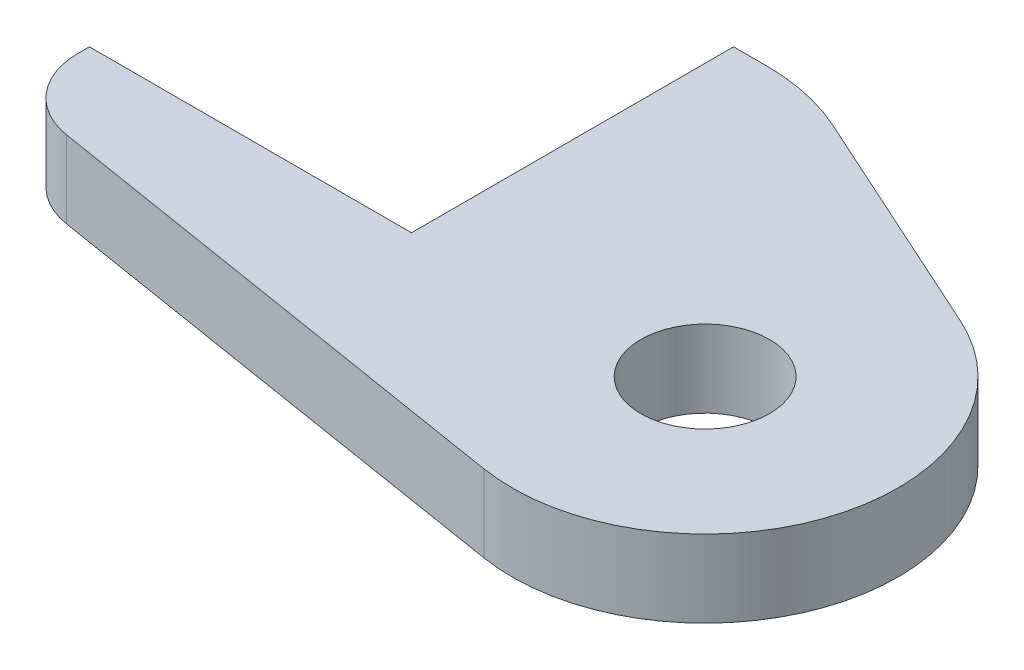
from build123d import *

# Parameters (mm, degrees)
SKETCH1_R           = 7.9375
BOSS_EXTRUDE1_DEPTH = 4.7625
CHAMFER1_SIZE       = 3.175


with BuildPart() as part:
    # Sketch1 → Boss-Extrude1 (new, symmetric)
    with BuildSketch(Plane(origin=(0, 0, 0), x_dir=(1, 0, 0), z_dir=(0, 1, 0))):
        with BuildLine():
            Line((224.155, 160.02), (224.155, 196.596))
            Line((224.155, 196.596), (231.369145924, 196.596))
            ThreePointArc((231.369145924, 196.596), (236.73136056, 196.023538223), (241.851869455, 194.331957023))
            Line((241.851869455, 194.331957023), (270.64364331, 181.286626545))
            ThreePointArc((270.64364331, 181.286626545), (283.614523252, 152.721596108), (257.014091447, 136.08964739))
            Line((257.014091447, 136.08964739), (195.583200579, 146.025409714))
            ThreePointArc((195.583200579, 146.025409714), (189.851026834, 149.254077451), (187.579, 155.428217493))
            Line((187.579, 155.428217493), (187.579, 160.02))
            Line((187.579, 160.02), (224.155, 160.02))
        make_face()
        with Locations(Location((260.81609, 159.596666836, 0), (0, 0, 90))):
            Circle(SKETCH1_R, mode=Mode.SUBTRACT)
    extrude(amount=BOSS_EXTRUDE1_DEPTH, both=True)

    # Chamfer1
    chamfer1_edges = [part.edges().sort_by_distance(p)[0] for p in [
        (205.867, -4.7625, -160.02),
        (224.155, 4.7625, -178.308),
        (205.867, 4.7625, -160.02),
        (224.155, -4.7625, -178.308),
    ]]
    chamfer(chamfer1_edges, length=CHAMFER1_SIZE)


solid = part.part
